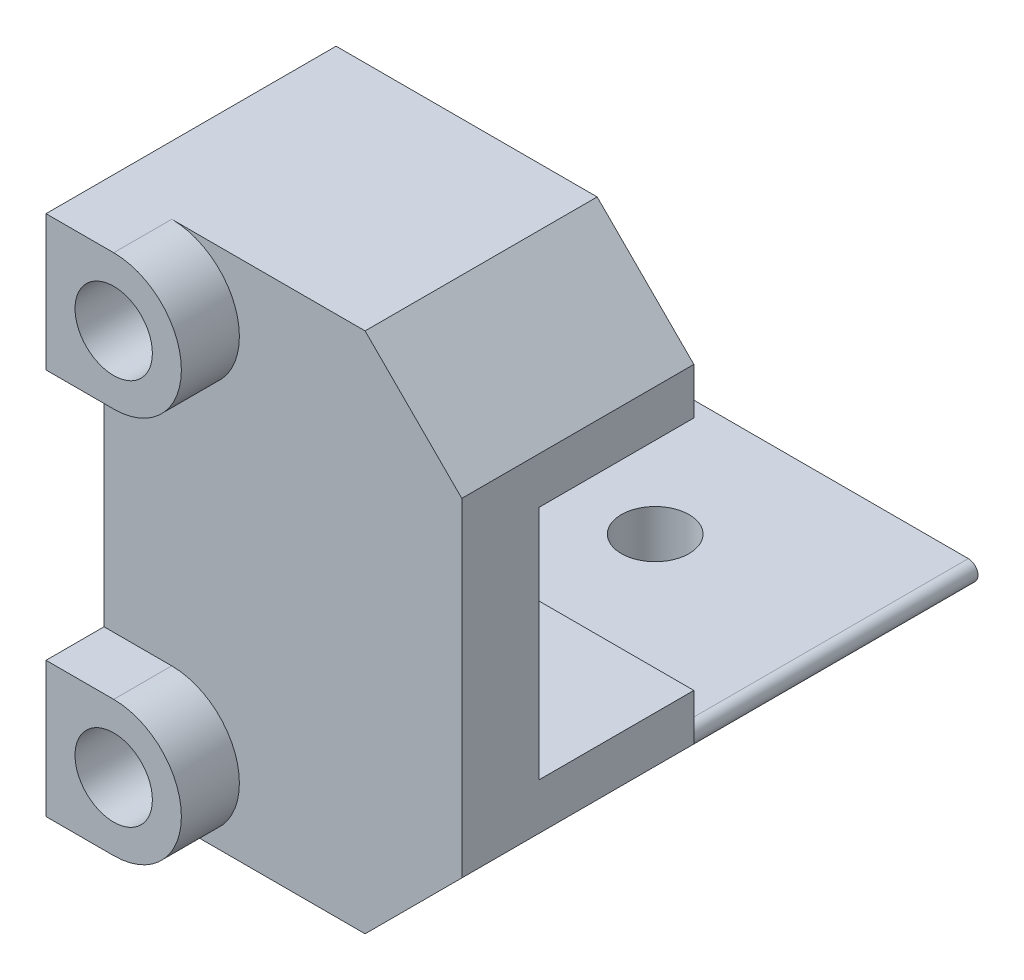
from build123d import *

# Parameters (mm, degrees)
SKIZZE1_W                          = 18.5
SKIZZE1_H                          = 27
AUFSATZ_LINEAR_AUSTRAGEN1_DEPTH    = 12
SKIZZE2_W                          = 8
SKIZZE2_H                          = 12.2
SCHNITT_LINEAR_AUSTRAGEN1_DEPTH    = 26.855366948
SKIZZE5_R                          = 3.5
AUFSATZ_LINEAR_AUSTRAGEN2_DEPTH    = 3
F_4_0_4_DURCHMESSER_BOHRUNG2_D     = 4
F_4_0_4_DURCHMESSER_BOHRUNG2_DEPTH = 6.5
FASE1_SIZE                         = 5
AUFSATZ_LINEAR_START               = -3
AUFSATZ_LINEAR_AUSTRAGEN3_DEPTH    = 3
AUFSATZ_LINEAR_AUSTRAGEN4_DEPTH    = 17
SKIZZE11_W                         = 17
SKIZZE11_H                         = 4
SCHNITT_LINEAR_AUSTRAGEN2_DEPTH    = 29.521921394
VERRUNDUNG2_R                      = 0.5
F_3_5_3_5_DURCHMESSER_BOHRUNG2_D   = 3.5


with BuildPart() as part:
    # Skizze1 → Aufsatz-Linear austragen1 (new body)
    with BuildSketch(Plane.XY):
        Rectangle(SKIZZE1_W, SKIZZE1_H)
    extrude(amount=AUFSATZ_LINEAR_AUSTRAGEN1_DEPTH)

    # Skizze2 → Schnitt-Linear austragen1 (cut, through all)
    with BuildSketch(Plane.ZY.offset(9.25)):
        with Locations((4, 0)):
            Rectangle(SKIZZE2_W, SKIZZE2_H)
    extrude(amount=-SCHNITT_LINEAR_AUSTRAGEN1_DEPTH, mode=Mode.SUBTRACT)

    # Skizze5 → Aufsatz-Linear austragen2 (add)
    with BuildSketch(Plane.XY.offset(12)):
        with Locations(Location((-5.75, 10, 0), (0, 0, 180))):
            Circle(SKIZZE5_R)
        with Locations(Location((-5.75, -10, 0), (0, 0, 180))):
            Circle(SKIZZE5_R)
    extrude(amount=AUFSATZ_LINEAR_AUSTRAGEN2_DEPTH)

    # 4.0 _4_ Durchmesser Bohrung2
    with Locations(Plane.XY.offset(15)):
        with Locations((-5.75, 10), (-5.75, -10)):
            Hole(F_4_0_4_DURCHMESSER_BOHRUNG2_D / 2, depth=F_4_0_4_DURCHMESSER_BOHRUNG2_DEPTH)

    # Fase1
    fase1_edges = [part.edges().sort_by_distance(p)[0] for p in [
        (9.25, -13.5, 6),
        (9.25, 13.5, 6),
    ]]
    chamfer(fase1_edges, length=FASE1_SIZE)

    # Skizze9 → Aufsatz-Linear austragen3 (add)
    with BuildSketch(Plane.XY.offset(15).offset(AUFSATZ_LINEAR_START)):
        with BuildLine():
            Line((-9.25, 6.5), (-5.75, 6.5))
            ThreePointArc((-5.75, 6.5), (-8.224873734, 7.525126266), (-9.25, 10))
            Line((-9.25, 10), (-9.25, 6.5))
        make_face()
        with BuildLine():
            Line((-9.25, 13.5), (-9.25, 10))
            ThreePointArc((-9.25, 10), (-8.224873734, 12.474873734), (-5.75, 13.5))
            Line((-5.75, 13.5), (-9.25, 13.5))
        make_face()
        with BuildLine():
            ThreePointArc((-9.25, -10), (-8.224873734, -7.525126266), (-5.75, -6.5))
            Line((-5.75, -6.5), (-9.25, -6.5))
            Line((-9.25, -6.5), (-9.25, -10))
        make_face()
        with BuildLine():
            ThreePointArc((-5.75, -13.5), (-8.224873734, -12.474873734), (-9.25, -10))
            Line((-9.25, -10), (-9.25, -13.5))
            Line((-9.25, -13.5), (-5.75, -13.5))
        make_face()
    extrude(amount=AUFSATZ_LINEAR_AUSTRAGEN3_DEPTH)

    # Skizze10 → Aufsatz-Linear austragen4 (add)
    with BuildSketch(Plane(origin=(0, 0, 0), x_dir=(-1, 0, 0), z_dir=(0, 0, -1))):
        Polygon((-9.25, -6.1), (-9.25, -8.5), (-4.25, -13.5), (9.25, -13.5), (9.25, -6.1), align=None)
    extrude(amount=AUFSATZ_LINEAR_AUSTRAGEN4_DEPTH)

    # Skizze11 → Schnitt-Linear austragen2 (cut, through all)
    with BuildSketch(Plane(origin=(9.25, 0, 0), x_dir=(0, 0, -1), z_dir=(1, 0, 0))):
        with Locations((8.5, -8.1)):
            Rectangle(SKIZZE11_W, SKIZZE11_H)
    extrude(amount=-SCHNITT_LINEAR_AUSTRAGEN2_DEPTH, mode=Mode.SUBTRACT)

    # Verrundung2
    verrundung2_edges = [part.edges().sort_by_distance(p)[0] for p in [
        (7.65, -10.1, -8.5),
    ]]
    fillet(verrundung2_edges, radius=VERRUNDUNG2_R)

    # 3.5 _3.5_ Durchmesser Bohrung2 (through all)
    with Locations(Plane(origin=(0, -13.5, 0), x_dir=(-1, 0, 0), z_dir=(0, -1, 0))):
        with Locations((2.75, 10)):
            Hole(F_3_5_3_5_DURCHMESSER_BOHRUNG2_D / 2)


solid = part.part
